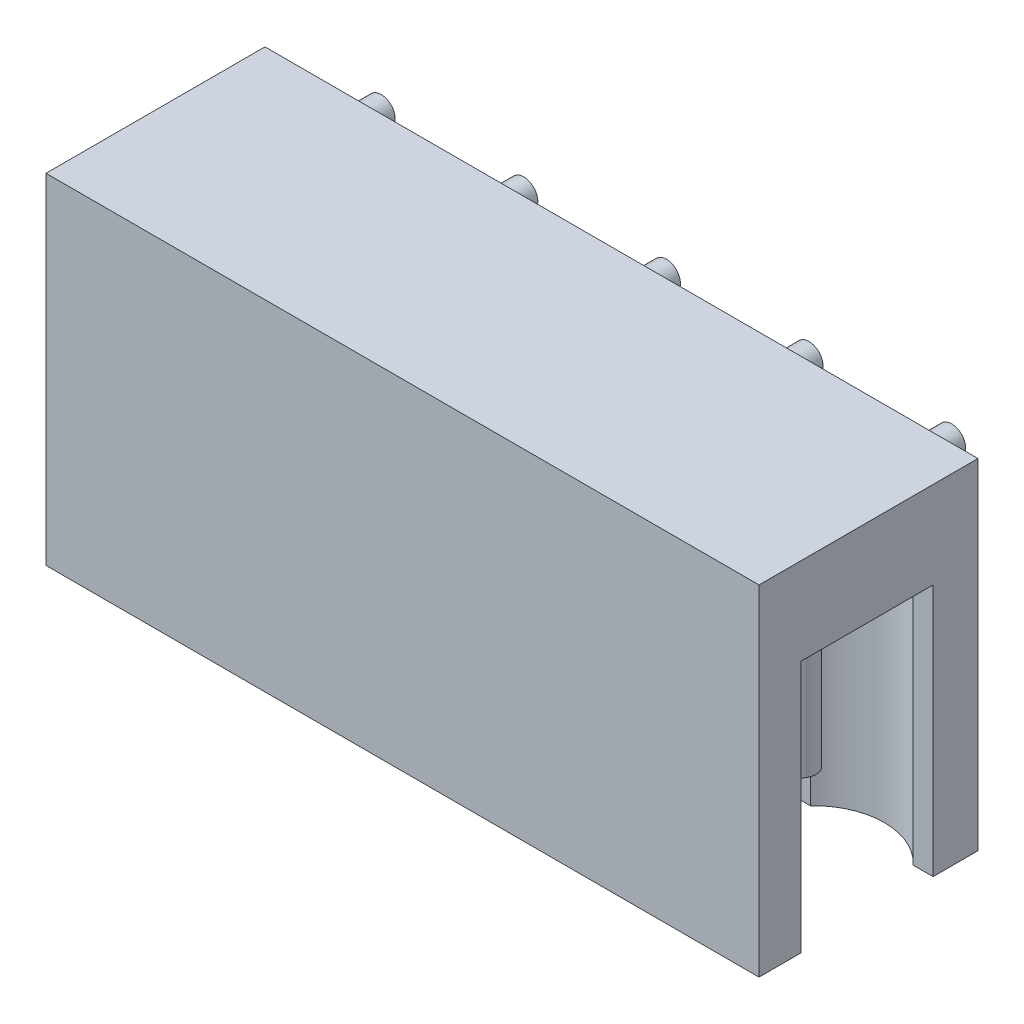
from build123d import *

# Parameters (mm, degrees)
ESQUISSE1_W             = 25.4
ESQUISSE1_H             = 12.1
BOSS_EXTRU_1_DEPTH      = 7.8
ESQUISSE2_R             = 0.5
BOSS_EXTRU_2_DEPTH      = 1.6
ENL_V_MAT_EXTRU_1_DEPTH = 9
ESQUISSE4_R             = 0.5
BOSS_EXTRU_3_DEPTH      = 5.8


with BuildPart() as part:
    # Esquisse1 → Boss.-Extru.1 (new body)
    with BuildSketch(Plane.XY):
        with Locations((12.7, 6.05)):
            Rectangle(ESQUISSE1_W, ESQUISSE1_H)
    extrude(amount=BOSS_EXTRU_1_DEPTH)

    # Esquisse2 → Boss.-Extru.2 (add)
    with BuildSketch(Plane(origin=(0, 0, 0), x_dir=(-1, 0, 0), z_dir=(0, 0, -1))):
        with Locations((-2.54, 10.6)):
            Circle(ESQUISSE2_R)
        with Locations((-7.62, 10.6)):
            Circle(ESQUISSE2_R)
        with Locations((-12.7, 10.6)):
            Circle(ESQUISSE2_R)
        with Locations((-17.78, 10.6)):
            Circle(ESQUISSE2_R)
        with Locations((-22.86, 10.6)):
            Circle(ESQUISSE2_R)
    extrude(amount=BOSS_EXTRU_2_DEPTH)

    # Esquisse3 → Enl_v. mat.-Extru.1 (cut)
    with BuildSketch(Plane.XZ):
        with BuildLine():
            Line((24.693030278, 1.6), (25.4, 1.6))
            Line((25.4, 1.6), (25.4, 6.3))
            Line((25.4, 6.3), (0, 6.3))
            Line((0, 6.3), (0, 1.6))
            Line((0, 1.6), (0.706969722, 1.6))
            ThreePointArc((0.706969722, 1.6), (2.54, 0.8), (4.373030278, 1.6))
            Line((4.373030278, 1.6), (5.786969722, 1.6))
            ThreePointArc((5.786969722, 1.6), (7.62, 0.8), (9.453030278, 1.6))
            Line((9.453030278, 1.6), (10.866969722, 1.6))
            ThreePointArc((10.866969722, 1.6), (12.7, 0.8), (14.533030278, 1.6))
            Line((14.533030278, 1.6), (15.946969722, 1.6))
            ThreePointArc((15.946969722, 1.6), (17.78, 0.8), (19.613030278, 1.6))
            Line((19.613030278, 1.6), (21.026969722, 1.6))
            ThreePointArc((21.026969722, 1.6), (22.86, 0.8), (24.693030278, 1.6))
        make_face()
    extrude(amount=-ENL_V_MAT_EXTRU_1_DEPTH, mode=Mode.SUBTRACT)

    # Esquisse4 → Boss.-Extru.3 (add)
    with BuildSketch(Plane.XZ.offset(-9)):
        with Locations(Location((22.86, 3.734646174, 0), (0, 0, 270))):
            Circle(ESQUISSE4_R)
        with Locations(Location((17.78, 3.734646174, 0), (0, 0, 270))):
            Circle(ESQUISSE4_R)
        with Locations(Location((12.7, 3.734646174, 0), (0, 0, 270))):
            Circle(ESQUISSE4_R)
        with Locations(Location((7.62, 3.734646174, 0), (0, 0, 270))):
            Circle(ESQUISSE4_R)
        with Locations(Location((2.54, 3.734646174, 0), (0, 0, 270))):
            Circle(ESQUISSE4_R)
    extrude(amount=BOSS_EXTRU_3_DEPTH)


solid = part.part
